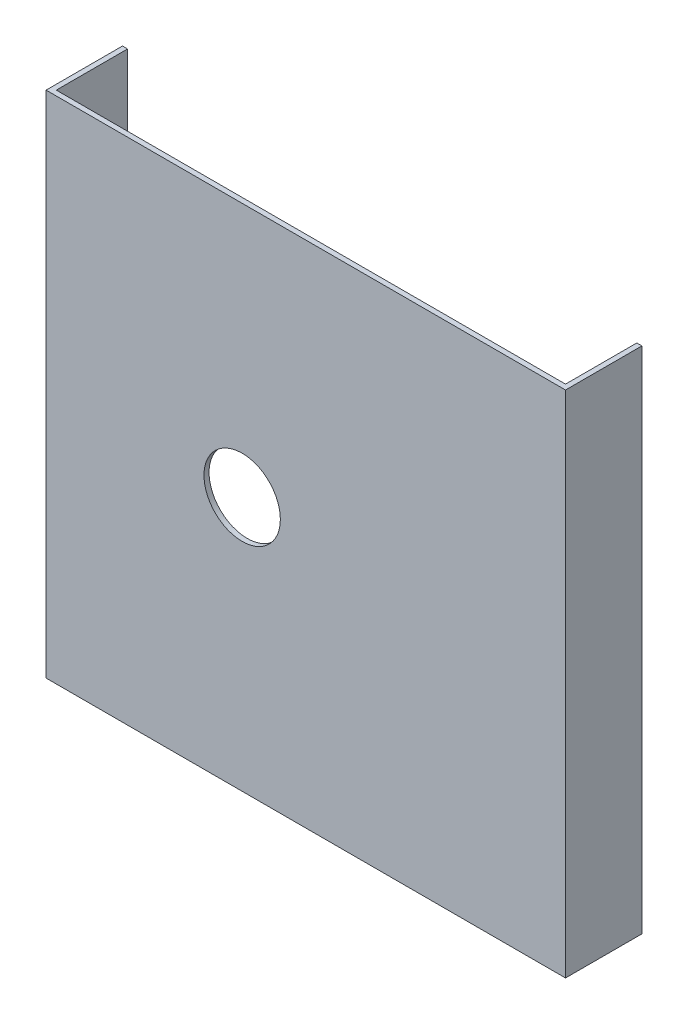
from build123d import *

# Parameters (mm, degrees)
SCHIZZO1_W                   = 200
SCHIZZO1_H                   = 200
SCHIZZO1_R                   = 15
ESTRUSIONE_ESTRUSIONE1_DEPTH = 2
SCHIZZO3_W                   = 30
SCHIZZO3_H                   = 200
ESTRUSIONE_ESTRUSIONE2_DEPTH = 2


with BuildPart() as part:
    # Schizzo1 → Estrusione-Estrusione1 (new body)
    with BuildSketch(Plane.XY):
        Rectangle(SCHIZZO1_W, SCHIZZO1_H)
        with Locations((-25, 0)):
            Circle(SCHIZZO1_R, mode=Mode.SUBTRACT)
    extrude(amount=ESTRUSIONE_ESTRUSIONE1_DEPTH)

    # Schizzo3 → Estrusione-Estrusione2 (add)
    with BuildSketch(Plane.ZY.offset(100)):
        with Locations((-13, 0)):
            Rectangle(SCHIZZO3_W, SCHIZZO3_H)
    estrusione_estrusione2 = extrude(amount=ESTRUSIONE_ESTRUSIONE2_DEPTH)

    # Specchia1: Estrusione-Estrusione2 across plane
    add(estrusione_estrusione2.mirror(Plane(origin=(0, 0, 0), x_dir=(0, 0, 1), z_dir=(1, 0, 0))))


solid = part.part
